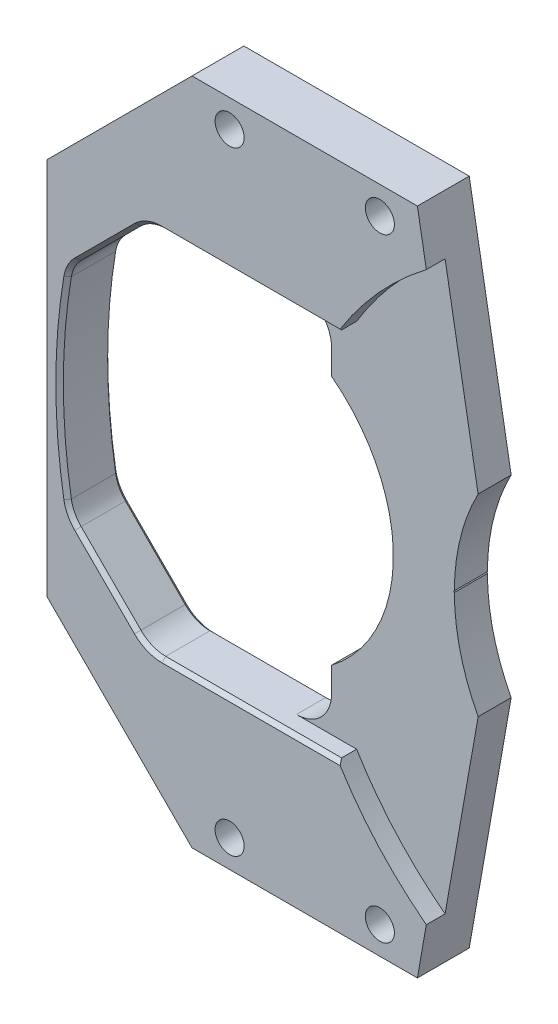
from build123d import *
from build123d.topology import SkipClean

# Parameters (mm, degrees)
SKETCH1_R                      = 19.05
SKETCH1_R_2                    = 15.9766
EXTRUDE1_DEPTH                 = 3.3528
EXTRUDE2_DEPTH                 = 3.3528
EXTRUDE3_DEPTH                 = 1.905
F_32_0_116000_DIAMETER_HOLE1_D = 2.9464
EXTRUDE4_DEPTH                 = 5.2578
CUT_EXTRUDE1_DEPTH             = 41.541248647
FILLET1_R                      = 3.556
FILLET1_OF_MIRROR3_R           = 3.556
CHAMFER3_SIZE                  = 4.318
SKETCH8_W                      = 19.734479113
SKETCH8_H                      = 13.438397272
CUT_EXTRUDE4_DEPTH             = 41.33843885
CHAMFER4_SIZE                  = 0.381
CHAMFER2_SIZE                  = 0.381
EXTRUDE5_START                 = -5.2578
EXTRUDE5_DEPTH                 = 5.2578
SKETCH10_R                     = 36.195
CUT_EXTRUDE5_DEPTH             = 43.011699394
CUT_EXTRUDE6_DEPTH             = 43.011699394


with BuildPart() as part:
    # Sketch1 → Extrude1 (new body)
    with BuildSketch(Plane.XY):
        Circle(SKETCH1_R)
        Circle(SKETCH1_R_2, mode=Mode.SUBTRACT)
    extrude(amount=EXTRUDE1_DEPTH)

    # Sketch2 → Extrude2 (add)
    with BuildSketch(Plane.XY):
        with BuildLine():
            Line((-2.54, 33.909), (-16.532953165, 9.463823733))
            ThreePointArc((-16.532953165, 9.463823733), (4.896414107, 18.409987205), (19.05, 0))
            Line((19.05, 0), (19.05, 33.909))
            Line((19.05, 33.909), (-2.54, 33.909))
        make_face()
    extrude2 = extrude(amount=EXTRUDE2_DEPTH)

    # Mirror1: Extrude2 across plane
    add(extrude2.mirror(Plane.ZX))

    # Sketch5 → Extrude3 (add)
    with BuildSketch(Plane.XY.offset(3.3528)):
        with BuildLine():
            Line((-2.54, -33.909), (19.05, -33.909))
            Line((19.05, -33.909), (19.05, -26.978160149))
            ThreePointArc((19.05, -26.978160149), (13.374144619, -20.535067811), (9.375707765, -12.93629976))
            ThreePointArc((9.375707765, -12.93629976), (-15.9766, 0), (9.375707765, 12.93629976))
            ThreePointArc((9.375707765, 12.93629976), (13.374144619, 20.535067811), (19.05, 26.978160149))
            Line((19.05, 26.978160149), (19.05, 33.909))
            Line((19.05, 33.909), (-2.54, 33.909))
            Line((-2.54, 33.909), (-16.532953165, 9.463823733))
            ThreePointArc((-16.532953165, 9.463823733), (-19.05, 0), (-16.532953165, -9.463823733))
            Line((-16.532953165, -9.463823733), (-2.54, -33.909))
        make_face()
    extrude(amount=EXTRUDE3_DEPTH)

    # 32 _0.116000_ Diameter Hole1 (through all)
    with Locations(Plane(origin=(-7.928934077, -24.287911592, 5.2578), x_dir=(1, 0, 0), z_dir=(0, 0, 1))):
        with Locations((24.438934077, -6.827088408), (9.198934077, -6.827088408), (9.198934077, 55.402911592), (24.438934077, 55.402911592)):
            Hole(F_32_0_116000_DIAMETER_HOLE1_D / 2)

    # Sketch6 → Extrude4 (add)
    with BuildSketch(Plane(origin=(0, 0, 0), x_dir=(-1, 0, 0), z_dir=(0, 0, -1))):
        with BuildLine():
            Line((2.54, 33.909), (21.59, 14.859))
            Line((21.59, 14.859), (21.59, 0))
            Line((21.59, 0), (15.9766, 0))
            ThreePointArc((15.9766, 0), (12.162078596, 10.360289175), (2.54, 15.7734))
            Line((2.54, 15.7734), (2.54, 33.909))
        make_face()
    extrude4 = extrude(amount=-EXTRUDE4_DEPTH)

    # Mirror2: Extrude4 across plane
    add(extrude4.mirror(Plane.ZX))

    # Sketch7 → Cut-Extrude1 (cut, through all)
    with BuildSketch(Plane(origin=(0, 0, 0), x_dir=(-1, 0, 0), z_dir=(0, 0, -1))):
        with BuildLine():
            Line((-9.7028, 18.796), (7.067137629, 18.796))
            Line((7.067137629, 18.796), (14.963866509, 10.89927112))
            ThreePointArc((14.963866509, 10.89927112), (15.722872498, 5.473110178), (15.9766, 0))
            Line((15.9766, 0), (-9.7028, 0))
            Line((-9.7028, 0), (-9.7028, 18.796))
        make_face()
    cut_extrude1 = extrude(amount=-CUT_EXTRUDE1_DEPTH, mode=Mode.SUBTRACT)

    # Fillet1
    fillet1_edges = [part.edges().sort_by_distance(p)[0] for p in [
        (9.7028, 18.796, 2.6289),
        (-7.067137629, 18.796, 2.6289),
        (-14.963866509, 10.89927112, 2.6289),
    ]]
    fillet(fillet1_edges, radius=FILLET1_R)

    # Mirror3: Cut-Extrude1 across plane
    add(cut_extrude1.mirror(Plane.ZX), mode=Mode.SUBTRACT)

    # Fillet1 of Mirror3
    fillet1_of_mirror3_edges = [part.edges().sort_by_distance(p)[0] for p in [
        (9.7028, -18.796, 2.6289),
        (-7.067137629, -18.796, 2.6289),
        (-14.963866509, -10.89927112, 2.6289),
    ]]
    fillet(fillet1_of_mirror3_edges, radius=FILLET1_OF_MIRROR3_R)

    # Chamfer3
    chamfer3_edges = [part.edges().sort_by_distance(p)[0] for p in [
        (-21.59, 0, 5.2578),
    ]]
    chamfer(chamfer3_edges, length=CHAMFER3_SIZE)

    # Sketch8 → Cut-Extrude4 (cut, through all)
    with BuildSketch(Plane.XY.offset(3.3528)):
        with Locations((13.800691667, 12.076801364)):
            Rectangle(SKETCH8_W, SKETCH8_H)
    cut_extrude4 = extrude(amount=CUT_EXTRUDE4_DEPTH, mode=Mode.SUBTRACT)

    # Mirror4: Cut-Extrude4 across plane
    add(cut_extrude4.mirror(Plane.ZX), mode=Mode.SUBTRACT)

    # Chamfer4
    chamfer4_edges = [part.edges().sort_by_distance(p)[0] for p in [
        (-11.140667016, 14.722470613, 5.2578),
        (-15.9766, 0, 5.2578),
        (3.326904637, 18.796, 5.2578),
        (-14.819552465, 10.804175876, 5.2578),
        (-6.955016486, 18.525315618, 5.2578),
        (-11.140667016, -14.722470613, 5.2578),
        (3.326904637, -18.796, 5.2578),
        (-14.819552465, -10.804175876, 5.2578),
        (-6.955016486, -18.525315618, 5.2578),
    ]]
    chamfer(chamfer4_edges, length=CHAMFER4_SIZE)

    # Chamfer2
    chamfer2_edges = [part.edges().sort_by_distance(p)[0] for p in [
        (-11.140667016, 14.722470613, 0),
        (0.2763029, 18.796, 0),
        (9.7028, 13.966404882, 0),
        (-14.819552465, 10.804175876, 0),
        (-6.955016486, 18.525315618, 0),
        (8.661271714, 17.754471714, 0),
        (15.9766, 0, 0),
        (-15.9766, 0, 0),
        (-11.140667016, -14.722470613, 0),
        (0.2763029, -18.796, 0),
        (9.7028, -13.966404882, 0),
        (-14.819552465, -10.804175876, 0),
        (-6.955016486, -18.525315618, 0),
        (8.661271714, -17.754471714, 0),
    ]]
    chamfer(chamfer2_edges, length=CHAMFER2_SIZE)

    # Sketch9 → Extrude5 (add)
    with SkipClean():  # the faces are left unmerged after this step: merging them gives an invalid solid
        with BuildSketch(Plane(origin=(0, 0, 0), x_dir=(-1, 0, 0), z_dir=(0, 0, -1)).offset(EXTRUDE5_START)):
            with BuildLine():
                Line((-19.05, 33.908999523), (-19.05, 0))
                Line((-19.05, 0), (-22.1615, 0))
                ThreePointArc((-22.1615, 0), (-22.773744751, 5.036078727), (-24.57481103, 9.778767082))
                Line((-24.57481103, 9.778767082), (-20.32, 33.908999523))
                Line((-20.32, 33.908999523), (-19.05, 33.908999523))
            make_face()
        extrude5 = extrude(amount=EXTRUDE5_DEPTH)

    # Mirror5: Extrude5 across plane
    with SkipClean():  # the faces are left unmerged after this step: merging them gives an invalid solid
        add(extrude5.mirror(Plane.ZX))

    # Sketch10 → Cut-Extrude5 (cut, through all)
    with SkipClean():  # the faces are left unmerged after this step: merging them gives an invalid solid
        with BuildSketch(Plane.XY.offset(3.3528)):
            with Locations((43.18, 0)):
                Circle(SKETCH10_R)
        extrude(amount=CUT_EXTRUDE5_DEPTH, mode=Mode.SUBTRACT)

    # Sketch11 → Cut-Extrude6 (cut, through all)
    with SkipClean():  # the faces are left unmerged after this step: merging them gives an invalid solid
        with BuildSketch(Plane.XY.offset(3.3528)):
            Polygon((22.0853, 0), (30.205772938, 8.120472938), (30.205772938, -8.120472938), align=None)
        extrude(amount=-CUT_EXTRUDE6_DEPTH, mode=Mode.SUBTRACT)


solid = part.part
